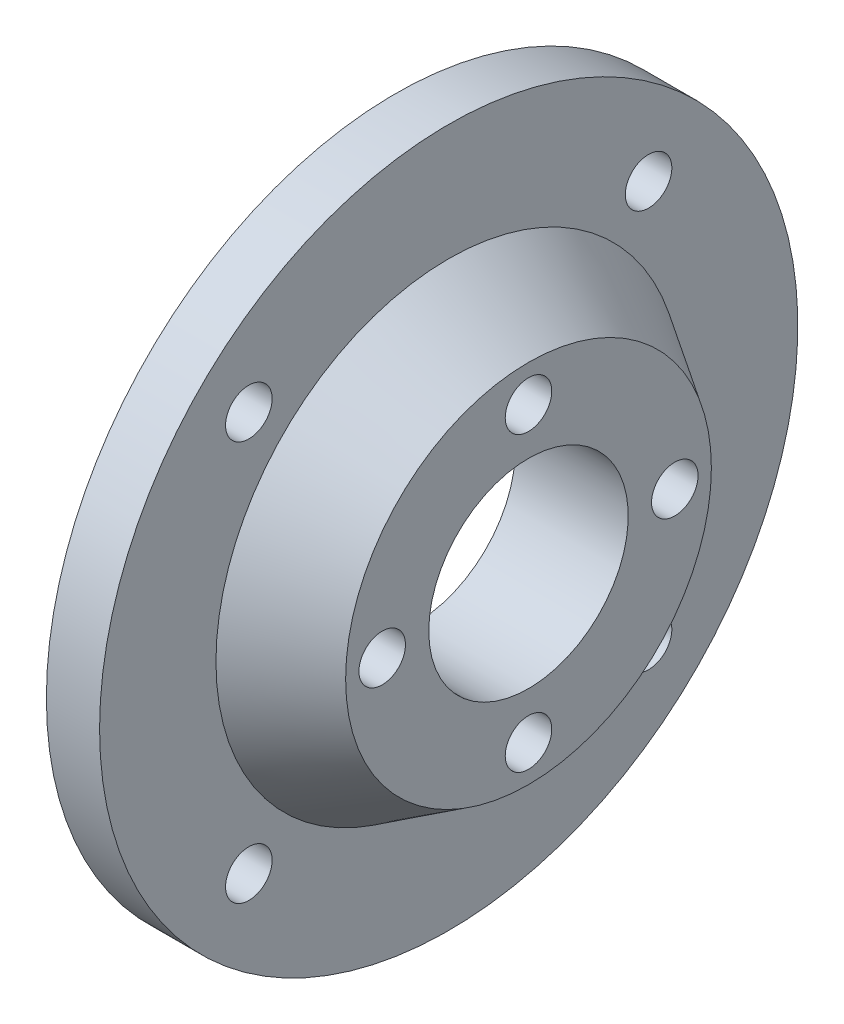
from build123d import *

# Parameters (mm, degrees)
ESQUISSE2_R             = 3.5
ENL_V_MAT_EXTRU_1_DEPTH = 77.892782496
ESQUISSE4_R             = 5
ENL_V_MAT_EXTRU_2_DEPTH = 8
ESQUISSE5_R             = 3.5
ENL_V_MAT_EXTRU_3_DEPTH = 38


with BuildPart() as part:
    # Esquisse1 → R_volution1 (revolve)
    with BuildSketch(Plane.XY, mode=Mode.PRIVATE) as r_volution1_sk:
        Polygon((-17, 15), (-17, 35), (-20, 35), (-20, 52.5), (0, 52.5), (0, 15), align=None)
    revolve(r_volution1_sk.sketch.rotate(Axis((0, 0, 0), (1, 0, 0)), 90), axis=Axis((0, 0, 0), (1, 0, 0)))

    # Esquisse2 → Enl_v. mat.-Extru.1 (cut, through all)
    with BuildSketch(Plane.ZY):
        with Locations((-30.0520382, 30.0520382)):
            Circle(ESQUISSE2_R)
        with Locations((30.0520382, 30.0520382)):
            Circle(ESQUISSE2_R)
        with Locations((30.0520382, -30.0520382)):
            Circle(ESQUISSE2_R)
        with Locations((-30.0520382, -30.0520382)):
            Circle(ESQUISSE2_R)
    extrude(amount=ENL_V_MAT_EXTRU_1_DEPTH, mode=Mode.SUBTRACT)

    # Esquisse3 → Enl_vement de mati_re-R_volution1 (revolve, cut)
    with BuildSketch(Plane.XY, mode=Mode.PRIVATE) as enl_vement_de_mati_re_r_volution1_sk:
        Polygon((-12, 56.864285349), (-12, 35), (6.209383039, 23.619135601), (6.209383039, 56.864285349), align=None)
    revolve(enl_vement_de_mati_re_r_volution1_sk.sketch.rotate(Axis((0, 0, 0), (-1, 0, 0)), 270), axis=Axis((0, 0, 0), (-1, 0, 0)), mode=Mode.SUBTRACT)

    # Esquisse4 → Enl_v. mat.-Extru.2 (cut)
    with BuildSketch(Plane.ZY.offset(17)):
        with Locations((0, 22)):
            Circle(ESQUISSE4_R)
        with Locations((22, 0)):
            Circle(ESQUISSE4_R)
        with Locations((0, -22)):
            Circle(ESQUISSE4_R)
        with Locations((-22, 0)):
            Circle(ESQUISSE4_R)
    extrude(amount=-ENL_V_MAT_EXTRU_2_DEPTH, mode=Mode.SUBTRACT)

    # Esquisse5 → Enl_v. mat.-Extru.3 (cut)
    with BuildSketch(Plane.ZY.offset(17)):
        with Locations((0, 22)):
            Circle(ESQUISSE5_R)
        with Locations((22, 0)):
            Circle(ESQUISSE5_R)
        with Locations((0, -22)):
            Circle(ESQUISSE5_R)
        with Locations((-22, 0)):
            Circle(ESQUISSE5_R)
    extrude(amount=-ENL_V_MAT_EXTRU_3_DEPTH, mode=Mode.SUBTRACT)


solid = part.part
